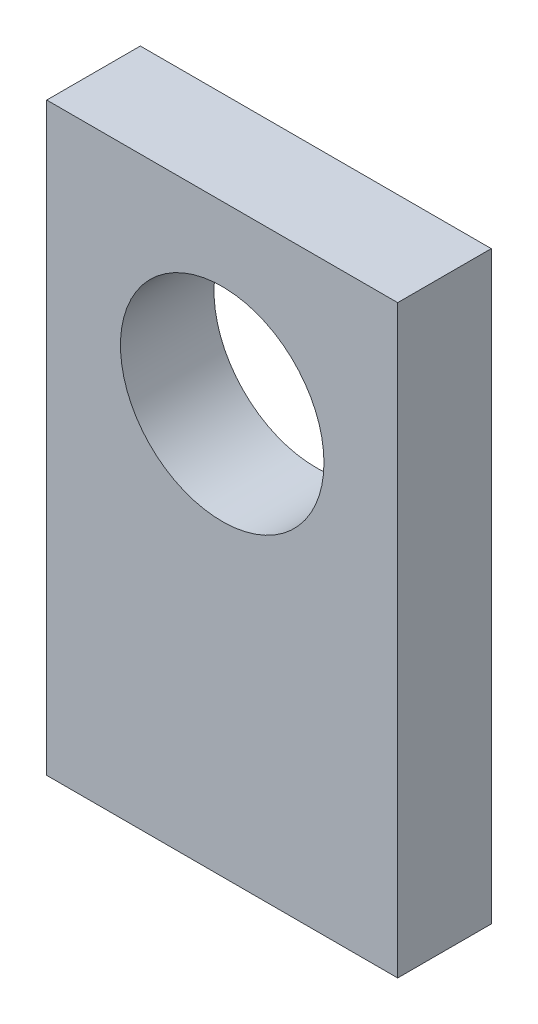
ISO-10303-21;
HEADER;
FILE_DESCRIPTION(('STEP AP214'),'2;1');
FILE_NAME('part.step','',(''),(''),'','','');
FILE_SCHEMA(('AUTOMOTIVE_DESIGN { 1 0 10303 214 1 1 1 1 }'));
ENDSEC;
DATA;
#1=APPLICATION_CONTEXT('core data for automotive mechanical design processes');
#2=APPLICATION_PROTOCOL_DEFINITION('international standard','automotive_design',2000,#1);
#3=PRODUCT_CONTEXT('',#1,'mechanical');
#4=PRODUCT('Part','Part','',(#3));
#5=PRODUCT_RELATED_PRODUCT_CATEGORY('part','',(#4));
#6=PRODUCT_DEFINITION_FORMATION('','',#4);
#7=PRODUCT_DEFINITION_CONTEXT('part definition',#1,'design');
#8=PRODUCT_DEFINITION('design','',#6,#7);
#9=PRODUCT_DEFINITION_SHAPE('','',#8);
#10=(LENGTH_UNIT() NAMED_UNIT(*) SI_UNIT(.MILLI.,.METRE.));
#11=(NAMED_UNIT(*) PLANE_ANGLE_UNIT() SI_UNIT($,.RADIAN.));
#12=(NAMED_UNIT(*) SI_UNIT($,.STERADIAN.) SOLID_ANGLE_UNIT());
#13=UNCERTAINTY_MEASURE_WITH_UNIT(LENGTH_MEASURE(1.E-05),#10,'distance_accuracy_value','');
#14=(GEOMETRIC_REPRESENTATION_CONTEXT(3) GLOBAL_UNCERTAINTY_ASSIGNED_CONTEXT((#13)) GLOBAL_UNIT_ASSIGNED_CONTEXT((#10,
#11,#12)) REPRESENTATION_CONTEXT('',''));
#15=CARTESIAN_POINT('',(0.,0.,0.));
#16=DIRECTION('',(0.,0.,1.));
#17=DIRECTION('',(1.,0.,0.));
#18=AXIS2_PLACEMENT_3D('',#15,#16,#17);
#19=CARTESIAN_POINT('',(0.,63.5,10.16));
#20=DIRECTION('',(0.,0.,-1.));
#21=DIRECTION('',(-1.,0.,0.));
#22=AXIS2_PLACEMENT_3D('',#19,#20,#21);
#23=PLANE('',#22);
#24=DIRECTION('',(0.,-1.,0.));
#25=VECTOR('',#24,1.);
#26=CARTESIAN_POINT('',(0.,0.,10.16));
#27=LINE('',#26,#25);
#28=CARTESIAN_POINT('',(0.,63.5,10.16));
#29=VERTEX_POINT('',#28);
#30=CARTESIAN_POINT('',(0.,0.,10.16));
#31=VERTEX_POINT('',#30);
#32=EDGE_CURVE('E83',#29,#31,#27,.T.);
#33=ORIENTED_EDGE('',*,*,#32,.T.);
#34=DIRECTION('',(1.,0.,0.));
#35=VECTOR('',#34,1.);
#36=CARTESIAN_POINT('',(0.,0.,10.16));
#37=LINE('',#36,#35);
#38=CARTESIAN_POINT('',(38.1,0.,10.16));
#39=VERTEX_POINT('',#38);
#40=EDGE_CURVE('E78',#31,#39,#37,.T.);
#41=ORIENTED_EDGE('',*,*,#40,.T.);
#42=DIRECTION('',(0.,1.,0.));
#43=VECTOR('',#42,1.);
#44=CARTESIAN_POINT('',(38.1,0.,10.16));
#45=LINE('',#44,#43);
#46=CARTESIAN_POINT('',(38.1,63.5,10.16));
#47=VERTEX_POINT('',#46);
#48=EDGE_CURVE('E81',#39,#47,#45,.T.);
#49=ORIENTED_EDGE('',*,*,#48,.T.);
#50=DIRECTION('',(-1.,0.,0.));
#51=VECTOR('',#50,1.);
#52=CARTESIAN_POINT('',(0.,63.5,10.16));
#53=LINE('',#52,#51);
#54=EDGE_CURVE('E48',#47,#29,#53,.T.);
#55=ORIENTED_EDGE('',*,*,#54,.T.);
#56=EDGE_LOOP('',(#33,#41,#49,#55));
#57=FACE_BOUND('',#56,.T.);
#58=CARTESIAN_POINT('',(19.05,44.45,10.16));
#59=DIRECTION('',(0.,0.,1.));
#60=DIRECTION('',(1.,0.,0.));
#61=AXIS2_PLACEMENT_3D('',#58,#59,#60);
#62=CIRCLE('',#61,11.049);
#63=CARTESIAN_POINT('',(30.099,44.45,10.16));
#64=VERTEX_POINT('',#63);
#65=EDGE_CURVE('E98',#64,#64,#62,.T.);
#66=ORIENTED_EDGE('',*,*,#65,.F.);
#67=EDGE_LOOP('',(#66));
#68=FACE_BOUND('',#67,.T.);
#69=ADVANCED_FACE('F31',(#57,#68),#23,.F.);
#70=CARTESIAN_POINT('',(0.,63.5,0.));
#71=DIRECTION('',(0.,0.,-1.));
#72=DIRECTION('',(-1.,0.,0.));
#73=AXIS2_PLACEMENT_3D('',#70,#71,#72);
#74=PLANE('',#73);
#75=DIRECTION('',(0.,-1.,0.));
#76=VECTOR('',#75,1.);
#77=CARTESIAN_POINT('',(0.,0.,0.));
#78=LINE('',#77,#76);
#79=CARTESIAN_POINT('',(0.,63.5,0.));
#80=VERTEX_POINT('',#79);
#81=CARTESIAN_POINT('',(0.,0.,0.));
#82=VERTEX_POINT('',#81);
#83=EDGE_CURVE('E95',#80,#82,#78,.T.);
#84=ORIENTED_EDGE('',*,*,#83,.F.);
#85=DIRECTION('',(-1.,0.,0.));
#86=VECTOR('',#85,1.);
#87=CARTESIAN_POINT('',(0.,63.5,0.));
#88=LINE('',#87,#86);
#89=CARTESIAN_POINT('',(38.1,63.5,0.));
#90=VERTEX_POINT('',#89);
#91=EDGE_CURVE('E71',#90,#80,#88,.T.);
#92=ORIENTED_EDGE('',*,*,#91,.F.);
#93=DIRECTION('',(0.,1.,0.));
#94=VECTOR('',#93,1.);
#95=CARTESIAN_POINT('',(38.1,0.,0.));
#96=LINE('',#95,#94);
#97=CARTESIAN_POINT('',(38.1,0.,0.));
#98=VERTEX_POINT('',#97);
#99=EDGE_CURVE('E65',#98,#90,#96,.T.);
#100=ORIENTED_EDGE('',*,*,#99,.F.);
#101=DIRECTION('',(1.,0.,0.));
#102=VECTOR('',#101,1.);
#103=CARTESIAN_POINT('',(0.,0.,0.));
#104=LINE('',#103,#102);
#105=EDGE_CURVE('E87',#82,#98,#104,.T.);
#106=ORIENTED_EDGE('',*,*,#105,.F.);
#107=EDGE_LOOP('',(#84,#92,#100,#106));
#108=FACE_BOUND('',#107,.T.);
#109=CARTESIAN_POINT('',(19.05,44.45,0.));
#110=DIRECTION('',(0.,0.,1.));
#111=DIRECTION('',(1.,0.,0.));
#112=AXIS2_PLACEMENT_3D('',#109,#110,#111);
#113=CIRCLE('',#112,11.049);
#114=CARTESIAN_POINT('',(30.099,44.45,0.));
#115=VERTEX_POINT('',#114);
#116=EDGE_CURVE('E110',#115,#115,#113,.T.);
#117=ORIENTED_EDGE('',*,*,#116,.T.);
#118=EDGE_LOOP('',(#117));
#119=FACE_BOUND('',#118,.T.);
#120=ADVANCED_FACE('F106',(#108,#119),#74,.T.);
#121=CARTESIAN_POINT('',(0.,0.,10.16));
#122=DIRECTION('',(1.,0.,0.));
#123=DIRECTION('',(0.,0.,-1.));
#124=AXIS2_PLACEMENT_3D('',#121,#122,#123);
#125=PLANE('',#124);
#126=ORIENTED_EDGE('',*,*,#83,.T.);
#127=DIRECTION('',(0.,0.,-1.));
#128=VECTOR('',#127,1.);
#129=CARTESIAN_POINT('',(0.,0.,10.16));
#130=LINE('',#129,#128);
#131=EDGE_CURVE('E11',#31,#82,#130,.T.);
#132=ORIENTED_EDGE('',*,*,#131,.F.);
#133=ORIENTED_EDGE('',*,*,#32,.F.);
#134=DIRECTION('',(0.,0.,-1.));
#135=VECTOR('',#134,1.);
#136=CARTESIAN_POINT('',(0.,63.5,10.16));
#137=LINE('',#136,#135);
#138=EDGE_CURVE('E91',#29,#80,#137,.T.);
#139=ORIENTED_EDGE('',*,*,#138,.T.);
#140=EDGE_LOOP('',(#126,#132,#133,#139));
#141=FACE_BOUND('',#140,.T.);
#142=ADVANCED_FACE('F33',(#141),#125,.F.);
#143=CARTESIAN_POINT('',(0.,0.,10.16));
#144=DIRECTION('',(0.,1.,0.));
#145=DIRECTION('',(0.,0.,1.));
#146=AXIS2_PLACEMENT_3D('',#143,#144,#145);
#147=PLANE('',#146);
#148=ORIENTED_EDGE('',*,*,#105,.T.);
#149=DIRECTION('',(0.,0.,-1.));
#150=VECTOR('',#149,1.);
#151=CARTESIAN_POINT('',(38.1,0.,10.16));
#152=LINE('',#151,#150);
#153=EDGE_CURVE('E40',#39,#98,#152,.T.);
#154=ORIENTED_EDGE('',*,*,#153,.F.);
#155=ORIENTED_EDGE('',*,*,#40,.F.);
#156=ORIENTED_EDGE('',*,*,#131,.T.);
#157=EDGE_LOOP('',(#148,#154,#155,#156));
#158=FACE_BOUND('',#157,.T.);
#159=ADVANCED_FACE('F86',(#158),#147,.F.);
#160=CARTESIAN_POINT('',(38.1,0.,10.16));
#161=DIRECTION('',(-1.,0.,0.));
#162=DIRECTION('',(0.,0.,1.));
#163=AXIS2_PLACEMENT_3D('',#160,#161,#162);
#164=PLANE('',#163);
#165=ORIENTED_EDGE('',*,*,#99,.T.);
#166=DIRECTION('',(0.,0.,-1.));
#167=VECTOR('',#166,1.);
#168=CARTESIAN_POINT('',(38.1,63.5,10.16));
#169=LINE('',#168,#167);
#170=EDGE_CURVE('E88',#47,#90,#169,.T.);
#171=ORIENTED_EDGE('',*,*,#170,.F.);
#172=ORIENTED_EDGE('',*,*,#48,.F.);
#173=ORIENTED_EDGE('',*,*,#153,.T.);
#174=EDGE_LOOP('',(#165,#171,#172,#173));
#175=FACE_BOUND('',#174,.T.);
#176=ADVANCED_FACE('F89',(#175),#164,.F.);
#177=CARTESIAN_POINT('',(0.,63.5,10.16));
#178=DIRECTION('',(0.,-1.,0.));
#179=DIRECTION('',(0.,0.,-1.));
#180=AXIS2_PLACEMENT_3D('',#177,#178,#179);
#181=PLANE('',#180);
#182=ORIENTED_EDGE('',*,*,#91,.T.);
#183=ORIENTED_EDGE('',*,*,#138,.F.);
#184=ORIENTED_EDGE('',*,*,#54,.F.);
#185=ORIENTED_EDGE('',*,*,#170,.T.);
#186=EDGE_LOOP('',(#182,#183,#184,#185));
#187=FACE_BOUND('',#186,.T.);
#188=ADVANCED_FACE('F103',(#187),#181,.F.);
#189=CARTESIAN_POINT('',(19.05,44.45,10.16));
#190=DIRECTION('',(0.,0.,-1.));
#191=DIRECTION('',(-1.,0.,0.));
#192=AXIS2_PLACEMENT_3D('',#189,#190,#191);
#193=CYLINDRICAL_SURFACE('',#192,11.049);
#194=ORIENTED_EDGE('',*,*,#65,.T.);
#195=EDGE_LOOP('',(#194));
#196=FACE_BOUND('',#195,.T.);
#197=ORIENTED_EDGE('',*,*,#116,.F.);
#198=EDGE_LOOP('',(#197));
#199=FACE_BOUND('',#198,.T.);
#200=ADVANCED_FACE('F116',(#196,#199),#193,.F.);
#201=CLOSED_SHELL('',(#69,#120,#142,#159,#176,#188,#200));
#202=MANIFOLD_SOLID_BREP('B2',#201);
#203=ADVANCED_BREP_SHAPE_REPRESENTATION('',(#18,#202),#14);
#204=SHAPE_DEFINITION_REPRESENTATION(#9,#203);
ENDSEC;
END-ISO-10303-21;
